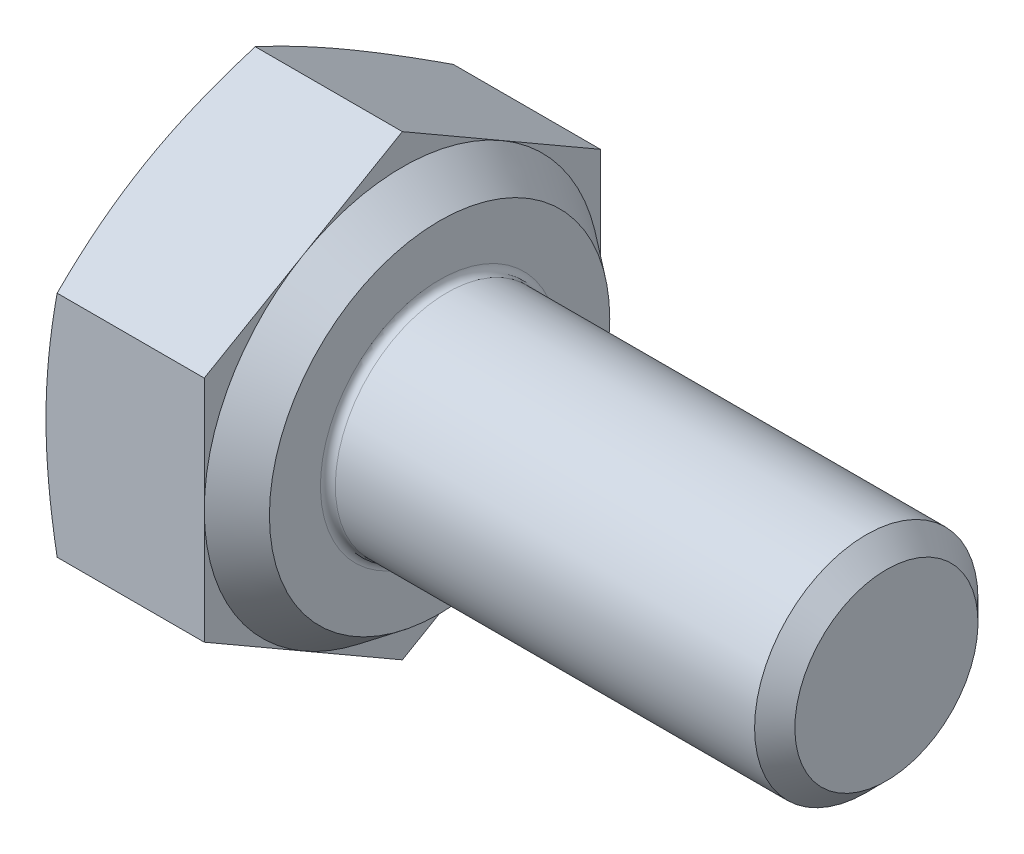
ISO-10303-21;
HEADER;
FILE_DESCRIPTION(('STEP AP214'),'2;1');
FILE_NAME('part.step','',(''),(''),'','','');
FILE_SCHEMA(('AUTOMOTIVE_DESIGN { 1 0 10303 214 1 1 1 1 }'));
ENDSEC;
DATA;
#1=APPLICATION_CONTEXT('core data for automotive mechanical design processes');
#2=APPLICATION_PROTOCOL_DEFINITION('international standard','automotive_design',2000,#1);
#3=PRODUCT_CONTEXT('',#1,'mechanical');
#4=PRODUCT('Part','Part','',(#3));
#5=PRODUCT_RELATED_PRODUCT_CATEGORY('part','',(#4));
#6=PRODUCT_DEFINITION_FORMATION('','',#4);
#7=PRODUCT_DEFINITION_CONTEXT('part definition',#1,'design');
#8=PRODUCT_DEFINITION('design','',#6,#7);
#9=PRODUCT_DEFINITION_SHAPE('','',#8);
#10=(LENGTH_UNIT() NAMED_UNIT(*) SI_UNIT(.MILLI.,.METRE.));
#11=(NAMED_UNIT(*) PLANE_ANGLE_UNIT() SI_UNIT($,.RADIAN.));
#12=(NAMED_UNIT(*) SI_UNIT($,.STERADIAN.) SOLID_ANGLE_UNIT());
#13=UNCERTAINTY_MEASURE_WITH_UNIT(LENGTH_MEASURE(1.E-05),#10,'distance_accuracy_value','');
#14=(GEOMETRIC_REPRESENTATION_CONTEXT(3) GLOBAL_UNCERTAINTY_ASSIGNED_CONTEXT((#13)) GLOBAL_UNIT_ASSIGNED_CONTEXT((#10,
#11,#12)) REPRESENTATION_CONTEXT('',''));
#15=CARTESIAN_POINT('',(0.,0.,0.));
#16=DIRECTION('',(0.,0.,1.));
#17=DIRECTION('',(1.,0.,0.));
#18=AXIS2_PLACEMENT_3D('',#15,#16,#17);
#19=CARTESIAN_POINT('',(2.625,0.,0.));
#20=DIRECTION('',(-1.,0.,0.));
#21=DIRECTION('',(0.,-1.,0.));
#22=AXIS2_PLACEMENT_3D('',#19,#20,#21);
#23=PLANE('',#22);
#24=CARTESIAN_POINT('',(2.625,0.,0.));
#25=DIRECTION('',(-1.,0.,0.));
#26=DIRECTION('',(0.,-1.,0.));
#27=AXIS2_PLACEMENT_3D('',#24,#25,#26);
#28=CIRCLE('',#27,1.6);
#29=CARTESIAN_POINT('',(2.625,-1.6,0.));
#30=VERTEX_POINT('',#29);
#31=EDGE_CURVE('E11',#30,#30,#28,.T.);
#32=ORIENTED_EDGE('',*,*,#31,.T.);
#33=EDGE_LOOP('',(#32));
#34=FACE_BOUND('',#33,.T.);
#35=CARTESIAN_POINT('',(2.625,0.,0.));
#36=DIRECTION('',(-1.,0.,0.));
#37=DIRECTION('',(0.,-1.,0.));
#38=AXIS2_PLACEMENT_3D('',#35,#36,#37);
#39=CIRCLE('',#38,2.285);
#40=CARTESIAN_POINT('',(2.625,-2.28499999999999,0.));
#41=VERTEX_POINT('',#40);
#42=EDGE_CURVE('E140',#41,#41,#39,.T.);
#43=ORIENTED_EDGE('',*,*,#42,.F.);
#44=EDGE_LOOP('',(#43));
#45=FACE_BOUND('',#44,.T.);
#46=ADVANCED_FACE('F32',(#34,#45),#23,.F.);
#47=CARTESIAN_POINT('',(2.125,0.,5.32));
#48=DIRECTION('',(-1.,0.,0.));
#49=DIRECTION('',(0.,0.,1.));
#50=AXIS2_PLACEMENT_3D('',#47,#48,#49);
#51=PLANE('',#50);
#52=DIRECTION('',(0.,-0.5,-0.866025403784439));
#53=VECTOR('',#52,1.);
#54=CARTESIAN_POINT('',(2.125,-1.53575171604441,2.66));
#55=LINE('',#54,#53);
#56=CARTESIAN_POINT('',(2.125,-1.53575171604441,2.66));
#57=VERTEX_POINT('',#56);
#58=CARTESIAN_POINT('',(2.125,-2.30362757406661,1.33));
#59=VERTEX_POINT('',#58);
#60=EDGE_CURVE('E139',#57,#59,#55,.T.);
#61=ORIENTED_EDGE('',*,*,#60,.T.);
#62=CARTESIAN_POINT('',(2.125,0.,0.));
#63=DIRECTION('',(-1.,0.,0.));
#64=DIRECTION('',(0.,-1.,0.));
#65=AXIS2_PLACEMENT_3D('',#62,#63,#64);
#66=CIRCLE('',#65,2.66);
#67=CARTESIAN_POINT('',(2.125,0.,2.66));
#68=VERTEX_POINT('',#67);
#69=EDGE_CURVE('E48',#59,#68,#66,.T.);
#70=ORIENTED_EDGE('',*,*,#69,.T.);
#71=DIRECTION('',(0.,-1.,0.));
#72=VECTOR('',#71,1.);
#73=CARTESIAN_POINT('',(2.125,1.53575171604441,2.66));
#74=LINE('',#73,#72);
#75=EDGE_CURVE('E136',#68,#57,#74,.T.);
#76=ORIENTED_EDGE('',*,*,#75,.T.);
#77=EDGE_LOOP('',(#61,#70,#76));
#78=FACE_BOUND('',#77,.T.);
#79=ADVANCED_FACE('F135',(#78),#51,.F.);
#80=CARTESIAN_POINT('',(2.125,1.53575171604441,2.66));
#81=VERTEX_POINT('',#80);
#82=EDGE_CURVE('E147',#81,#68,#74,.T.);
#83=ORIENTED_EDGE('',*,*,#82,.T.);
#84=CARTESIAN_POINT('',(2.125,2.30362757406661,1.33));
#85=VERTEX_POINT('',#84);
#86=EDGE_CURVE('E122',#68,#85,#66,.T.);
#87=ORIENTED_EDGE('',*,*,#86,.T.);
#88=DIRECTION('',(0.,-0.5,0.866025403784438));
#89=VECTOR('',#88,1.);
#90=CARTESIAN_POINT('',(2.125,3.07150343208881,0.));
#91=LINE('',#90,#89);
#92=EDGE_CURVE('E153',#85,#81,#91,.T.);
#93=ORIENTED_EDGE('',*,*,#92,.T.);
#94=EDGE_LOOP('',(#83,#87,#93));
#95=FACE_BOUND('',#94,.T.);
#96=ADVANCED_FACE('F152',(#95),#51,.F.);
#97=CARTESIAN_POINT('',(2.125,3.07150343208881,0.));
#98=VERTEX_POINT('',#97);
#99=EDGE_CURVE('E150',#98,#85,#91,.T.);
#100=ORIENTED_EDGE('',*,*,#99,.T.);
#101=CARTESIAN_POINT('',(2.125,2.30362757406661,-1.33));
#102=VERTEX_POINT('',#101);
#103=EDGE_CURVE('E126',#85,#102,#66,.T.);
#104=ORIENTED_EDGE('',*,*,#103,.T.);
#105=DIRECTION('',(0.,0.5,0.866025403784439));
#106=VECTOR('',#105,1.);
#107=CARTESIAN_POINT('',(2.125,1.53575171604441,-2.66));
#108=LINE('',#107,#106);
#109=EDGE_CURVE('E309',#102,#98,#108,.T.);
#110=ORIENTED_EDGE('',*,*,#109,.T.);
#111=EDGE_LOOP('',(#100,#104,#110));
#112=FACE_BOUND('',#111,.T.);
#113=ADVANCED_FACE('F298',(#112),#51,.F.);
#114=CARTESIAN_POINT('',(2.125,1.53575171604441,-2.66));
#115=VERTEX_POINT('',#114);
#116=EDGE_CURVE('E312',#115,#102,#108,.T.);
#117=ORIENTED_EDGE('',*,*,#116,.T.);
#118=CARTESIAN_POINT('',(2.125,0.,-2.66));
#119=VERTEX_POINT('',#118);
#120=EDGE_CURVE('E371',#102,#119,#66,.T.);
#121=ORIENTED_EDGE('',*,*,#120,.T.);
#122=DIRECTION('',(0.,1.,0.));
#123=VECTOR('',#122,1.);
#124=CARTESIAN_POINT('',(2.125,-1.53575171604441,-2.66));
#125=LINE('',#124,#123);
#126=EDGE_CURVE('E310',#119,#115,#125,.T.);
#127=ORIENTED_EDGE('',*,*,#126,.T.);
#128=EDGE_LOOP('',(#117,#121,#127));
#129=FACE_BOUND('',#128,.T.);
#130=ADVANCED_FACE('F291',(#129),#51,.F.);
#131=CARTESIAN_POINT('',(2.125,-1.53575171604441,-2.66));
#132=VERTEX_POINT('',#131);
#133=EDGE_CURVE('E303',#132,#119,#125,.T.);
#134=ORIENTED_EDGE('',*,*,#133,.T.);
#135=CARTESIAN_POINT('',(2.125,-2.3036275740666,-1.33));
#136=VERTEX_POINT('',#135);
#137=EDGE_CURVE('E304',#119,#136,#66,.T.);
#138=ORIENTED_EDGE('',*,*,#137,.T.);
#139=DIRECTION('',(0.,0.5,-0.866025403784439));
#140=VECTOR('',#139,1.);
#141=CARTESIAN_POINT('',(2.125,-3.07150343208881,0.));
#142=LINE('',#141,#140);
#143=EDGE_CURVE('E306',#136,#132,#142,.T.);
#144=ORIENTED_EDGE('',*,*,#143,.T.);
#145=EDGE_LOOP('',(#134,#138,#144));
#146=FACE_BOUND('',#145,.T.);
#147=ADVANCED_FACE('F283',(#146),#51,.F.);
#148=CARTESIAN_POINT('',(2.125,-1.53575171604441,2.66));
#149=DIRECTION('',(0.,0.866025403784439,-0.5));
#150=DIRECTION('',(0.,0.5,0.866025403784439));
#151=AXIS2_PLACEMENT_3D('',#148,#149,#150);
#152=PLANE('',#151);
#153=CARTESIAN_POINT('',(0.149817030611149,-3.07161890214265,-0.000199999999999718));
#154=CARTESIAN_POINT('',(0.126655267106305,-3.00801054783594,0.109972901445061));
#155=CARTESIAN_POINT('',(0.105585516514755,-2.94419242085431,0.22050913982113));
#156=CARTESIAN_POINT('',(0.068516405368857,-2.81614115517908,0.442300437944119));
#157=CARTESIAN_POINT('',(0.0525210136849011,-2.75190773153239,0.553555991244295));
#158=CARTESIAN_POINT('',(0.0266488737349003,-2.62373882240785,0.775551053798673));
#159=CARTESIAN_POINT('',(0.0167156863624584,-2.55980626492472,0.886285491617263));
#160=CARTESIAN_POINT('',(0.00339247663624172,-2.43179161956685,1.10801336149));
#161=CARTESIAN_POINT('',(0.,-2.36770959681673,1.219006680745));
#162=CARTESIAN_POINT('',(0.,-2.23954555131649,1.440993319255));
#163=CARTESIAN_POINT('',(0.00339247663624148,-2.17546352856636,1.55198663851));
#164=CARTESIAN_POINT('',(0.016715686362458,-2.04744888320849,1.77371450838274));
#165=CARTESIAN_POINT('',(0.0266488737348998,-1.98351632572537,1.88444894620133));
#166=CARTESIAN_POINT('',(0.0525210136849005,-1.85534741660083,2.10644400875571));
#167=CARTESIAN_POINT('',(0.0685164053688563,-1.79111399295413,2.21769956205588));
#168=CARTESIAN_POINT('',(0.105585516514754,-1.66306272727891,2.43949086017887));
#169=CARTESIAN_POINT('',(0.126655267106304,-1.59924460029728,2.55002709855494));
#170=CARTESIAN_POINT('',(0.149817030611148,-1.53563624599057,2.6602));
#171=B_SPLINE_CURVE_WITH_KNOTS('',3,(#153,#154,#155,#156,#157,#158,#159,#160,#161,#162,#163,
#164,#165,#166,#167,#168,#169,#170),.UNSPECIFIED.,.F.,.F.,(4,2,2,2,2,2,2,2,4),(0.,
0.387964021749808,0.776230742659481,1.16082524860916,1.54527541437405,1.92972558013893,
2.31432008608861,2.70258680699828,3.09055082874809),.UNSPECIFIED.);
#172=CARTESIAN_POINT('',(0.149775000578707,-3.0715034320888,0.));
#173=VERTEX_POINT('',#172);
#174=CARTESIAN_POINT('',(0.,-2.3036275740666,1.33));
#175=VERTEX_POINT('',#174);
#176=EDGE_CURVE('E352',#173,#175,#171,.T.);
#177=ORIENTED_EDGE('',*,*,#176,.F.);
#178=DIRECTION('',(-1.,0.,0.));
#179=VECTOR('',#178,1.);
#180=CARTESIAN_POINT('',(2.125,-3.07150343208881,0.));
#181=LINE('',#180,#179);
#182=CARTESIAN_POINT('',(2.125,-3.07150343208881,0.));
#183=VERTEX_POINT('',#182);
#184=EDGE_CURVE('E170',#183,#173,#181,.T.);
#185=ORIENTED_EDGE('',*,*,#184,.F.);
#186=EDGE_CURVE('E360',#59,#183,#55,.T.);
#187=ORIENTED_EDGE('',*,*,#186,.F.);
#188=ORIENTED_EDGE('',*,*,#60,.F.);
#189=DIRECTION('',(-1.,0.,0.));
#190=VECTOR('',#189,1.);
#191=CARTESIAN_POINT('',(2.125,-1.53575171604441,2.66));
#192=LINE('',#191,#190);
#193=CARTESIAN_POINT('',(0.149775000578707,-1.53575171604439,2.66));
#194=VERTEX_POINT('',#193);
#195=EDGE_CURVE('E149',#57,#194,#192,.T.);
#196=ORIENTED_EDGE('',*,*,#195,.T.);
#197=EDGE_CURVE('E240',#175,#194,#171,.T.);
#198=ORIENTED_EDGE('',*,*,#197,.F.);
#199=EDGE_LOOP('',(#177,#185,#187,#188,#196,#198));
#200=FACE_BOUND('',#199,.T.);
#201=ADVANCED_FACE('F34',(#200),#152,.F.);
#202=CARTESIAN_POINT('',(2.125,-3.07150343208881,0.));
#203=DIRECTION('',(0.,0.866025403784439,0.5));
#204=DIRECTION('',(0.,-0.5,0.866025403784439));
#205=AXIS2_PLACEMENT_3D('',#202,#203,#204);
#206=PLANE('',#205);
#207=CARTESIAN_POINT('',(0.149817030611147,-1.53563624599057,-2.6602));
#208=CARTESIAN_POINT('',(0.126655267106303,-1.59924460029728,-2.55002709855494));
#209=CARTESIAN_POINT('',(0.105585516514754,-1.66306272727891,-2.43949086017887));
#210=CARTESIAN_POINT('',(0.0685164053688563,-1.79111399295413,-2.21769956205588));
#211=CARTESIAN_POINT('',(0.0525210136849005,-1.85534741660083,-2.1064440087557));
#212=CARTESIAN_POINT('',(0.0266488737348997,-1.98351632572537,-1.88444894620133));
#213=CARTESIAN_POINT('',(0.016715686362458,-2.04744888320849,-1.77371450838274));
#214=CARTESIAN_POINT('',(0.00339247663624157,-2.17546352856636,-1.55198663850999));
#215=CARTESIAN_POINT('',(0.,-2.23954555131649,-1.440993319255));
#216=CARTESIAN_POINT('',(0.,-2.36770959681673,-1.219006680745));
#217=CARTESIAN_POINT('',(0.00339247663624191,-2.43179161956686,-1.10801336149));
#218=CARTESIAN_POINT('',(0.0167156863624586,-2.55980626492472,-0.886285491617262));
#219=CARTESIAN_POINT('',(0.0266488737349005,-2.62373882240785,-0.775551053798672));
#220=CARTESIAN_POINT('',(0.0525210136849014,-2.75190773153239,-0.553555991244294));
#221=CARTESIAN_POINT('',(0.0685164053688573,-2.81614115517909,-0.442300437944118));
#222=CARTESIAN_POINT('',(0.105585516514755,-2.94419242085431,-0.220509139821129));
#223=CARTESIAN_POINT('',(0.126655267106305,-3.00801054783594,-0.10997290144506));
#224=CARTESIAN_POINT('',(0.149817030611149,-3.07161890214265,0.000200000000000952));
#225=B_SPLINE_CURVE_WITH_KNOTS('',3,(#207,#208,#209,#210,#211,#212,#213,#214,#215,#216,#217,
#218,#219,#220,#221,#222,#223,#224),.UNSPECIFIED.,.F.,.F.,(4,2,2,2,2,2,2,2,4),(0.,
0.387964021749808,0.77623074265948,1.16082524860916,1.54527541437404,1.92972558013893,
2.31432008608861,2.70258680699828,3.09055082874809),.UNSPECIFIED.);
#226=CARTESIAN_POINT('',(0.149775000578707,-1.53575171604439,-2.66));
#227=VERTEX_POINT('',#226);
#228=CARTESIAN_POINT('',(0.,-2.3036275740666,-1.33));
#229=VERTEX_POINT('',#228);
#230=EDGE_CURVE('E255',#227,#229,#225,.T.);
#231=ORIENTED_EDGE('',*,*,#230,.F.);
#232=DIRECTION('',(-1.,0.,0.));
#233=VECTOR('',#232,1.);
#234=CARTESIAN_POINT('',(2.125,-1.53575171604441,-2.66));
#235=LINE('',#234,#233);
#236=EDGE_CURVE('E167',#132,#227,#235,.T.);
#237=ORIENTED_EDGE('',*,*,#236,.F.);
#238=ORIENTED_EDGE('',*,*,#143,.F.);
#239=EDGE_CURVE('E313',#183,#136,#142,.T.);
#240=ORIENTED_EDGE('',*,*,#239,.F.);
#241=ORIENTED_EDGE('',*,*,#184,.T.);
#242=EDGE_CURVE('E251',#229,#173,#225,.T.);
#243=ORIENTED_EDGE('',*,*,#242,.F.);
#244=EDGE_LOOP('',(#231,#237,#238,#240,#241,#243));
#245=FACE_BOUND('',#244,.T.);
#246=ADVANCED_FACE('F262',(#245),#206,.F.);
#247=CARTESIAN_POINT('',(2.125,-1.53575171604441,-2.66));
#248=DIRECTION('',(0.,0.,1.));
#249=DIRECTION('',(1.,0.,0.));
#250=AXIS2_PLACEMENT_3D('',#247,#248,#249);
#251=PLANE('',#250);
#252=CARTESIAN_POINT('',(0.80033820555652,-4.0661305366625,-2.66));
#253=CARTESIAN_POINT('',(0.763692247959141,-3.9457824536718,-2.66));
#254=CARTESIAN_POINT('',(0.727473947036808,-3.82530183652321,-2.66));
#255=CARTESIAN_POINT('',(0.656129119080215,-3.58400782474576,-2.66));
#256=CARTESIAN_POINT('',(0.621002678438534,-3.4631944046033,-2.66));
#257=CARTESIAN_POINT('',(0.552019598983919,-3.22096029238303,-2.66));
#258=CARTESIAN_POINT('',(0.518165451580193,-3.09953888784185,-2.66));
#259=CARTESIAN_POINT('',(0.452123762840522,-2.85624515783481,-2.66));
#260=CARTESIAN_POINT('',(0.419936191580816,-2.73437284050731,-2.66));
#261=CARTESIAN_POINT('',(0.358023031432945,-2.49160023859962,-2.66));
#262=CARTESIAN_POINT('',(0.328271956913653,-2.37070652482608,-2.66));
#263=CARTESIAN_POINT('',(0.271306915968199,-2.1283243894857,-2.66));
#264=CARTESIAN_POINT('',(0.244093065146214,-2.006835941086,-2.66));
#265=CARTESIAN_POINT('',(0.167186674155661,-1.64142901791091,-2.66));
#266=CARTESIAN_POINT('',(0.122197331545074,-1.39644838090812,-2.66));
#267=CARTESIAN_POINT('',(0.0708271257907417,-1.04074258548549,-2.66));
#268=CARTESIAN_POINT('',(0.0568876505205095,-0.931102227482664,-2.66));
#269=CARTESIAN_POINT('',(0.0332945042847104,-0.711365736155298,-2.66));
#270=CARTESIAN_POINT('',(0.0236403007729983,-0.601269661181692,-2.66));
#271=CARTESIAN_POINT('',(0.00907749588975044,-0.380832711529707,-2.66));
#272=CARTESIAN_POINT('',(0.0041657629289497,-0.270492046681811,-2.66));
#273=CARTESIAN_POINT('',(-0.00066185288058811,-0.0497001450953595,-2.66));
#274=CARTESIAN_POINT('',(-0.000577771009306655,0.0607510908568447,-2.66));
#275=CARTESIAN_POINT('',(0.00459443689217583,0.28209284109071,-2.66));
#276=CARTESIAN_POINT('',(0.00970784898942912,0.392982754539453,-2.66));
#277=CARTESIAN_POINT('',(0.0247038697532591,0.614440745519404,-2.66));
#278=CARTESIAN_POINT('',(0.0345867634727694,0.725008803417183,-2.66));
#279=CARTESIAN_POINT('',(0.058658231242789,0.94576301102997,-2.66));
#280=CARTESIAN_POINT('',(0.0728504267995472,1.05594876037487,-2.66));
#281=CARTESIAN_POINT('',(0.104968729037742,1.27576754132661,-2.66));
#282=CARTESIAN_POINT('',(0.122894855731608,1.38540056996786,-2.66));
#283=CARTESIAN_POINT('',(0.183438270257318,1.72501827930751,-2.66));
#284=CARTESIAN_POINT('',(0.231440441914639,1.95404028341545,-2.66));
#285=CARTESIAN_POINT('',(0.336683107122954,2.40995741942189,-2.66));
#286=CARTESIAN_POINT('',(0.393926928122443,2.63685175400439,-2.66));
#287=CARTESIAN_POINT('',(0.514573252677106,3.08929571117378,-2.66));
#288=CARTESIAN_POINT('',(0.577983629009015,3.31484321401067,-2.66));
#289=CARTESIAN_POINT('',(0.708883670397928,3.76470051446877,-2.66));
#290=CARTESIAN_POINT('',(0.776372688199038,3.9890105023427,-2.66));
#291=CARTESIAN_POINT('',(0.91341260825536,4.43428675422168,-2.66));
#292=CARTESIAN_POINT('',(0.98293252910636,4.65526259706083,-2.66));
#293=CARTESIAN_POINT('',(1.12394706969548,5.0965928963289,-2.66));
#294=CARTESIAN_POINT('',(1.19544178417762,5.31694732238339,-2.66));
#295=CARTESIAN_POINT('',(1.33959659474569,5.75634755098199,-2.66));
#296=CARTESIAN_POINT('',(1.41225123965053,5.9753951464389,-2.66));
#297=CARTESIAN_POINT('',(1.55864986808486,6.41310625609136,-2.66));
#298=CARTESIAN_POINT('',(1.63239376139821,6.63176980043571,-2.66));
#299=CARTESIAN_POINT('',(1.70651873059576,6.8503022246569,-2.66));
#300=B_SPLINE_CURVE_WITH_KNOTS('',3,(#252,#253,#254,#255,#256,#257,#258,#259,#260,#261,#262,
#263,#264,#265,#266,#267,#268,#269,#270,#271,#272,#273,#274,#275,#276,#277,#278,#279,#280,#281,
#282,#283,#284,#285,#286,#287,#288,#289,#290,#291,#292,#293,#294,#295,#296,#297,#298,#299),
.UNSPECIFIED.,.F.,.F.,(4,2,2,2,2,2,2,2,2,2,2,2,2,2,2,2,2,2,2,2,2,2,2,4),(0.,0.377413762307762,
0.75485731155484,1.13300507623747,1.51114604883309,1.88461936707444,2.25810969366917,
3.004716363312,3.3362177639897,3.66767795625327,3.99891912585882,4.33015795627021,
4.663070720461,4.99600338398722,5.32921661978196,5.66243164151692,6.36408571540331,
7.06599298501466,7.76880844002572,8.47151265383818,9.16646049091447,9.86144172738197,
10.5537859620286,11.2460731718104),.UNSPECIFIED.);
#301=CARTESIAN_POINT('',(0.149775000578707,1.53575171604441,-2.66));
#302=VERTEX_POINT('',#301);
#303=CARTESIAN_POINT('',(0.,0.,-2.66));
#304=VERTEX_POINT('',#303);
#305=EDGE_CURVE('E361',#302,#304,#300,.F.);
#306=ORIENTED_EDGE('',*,*,#305,.F.);
#307=DIRECTION('',(-1.,0.,0.));
#308=VECTOR('',#307,1.);
#309=CARTESIAN_POINT('',(2.125,1.53575171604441,-2.66));
#310=LINE('',#309,#308);
#311=EDGE_CURVE('E164',#115,#302,#310,.T.);
#312=ORIENTED_EDGE('',*,*,#311,.F.);
#313=ORIENTED_EDGE('',*,*,#126,.F.);
#314=ORIENTED_EDGE('',*,*,#133,.F.);
#315=ORIENTED_EDGE('',*,*,#236,.T.);
#316=EDGE_CURVE('E256',#304,#227,#300,.F.);
#317=ORIENTED_EDGE('',*,*,#316,.F.);
#318=EDGE_LOOP('',(#306,#312,#313,#314,#315,#317));
#319=FACE_BOUND('',#318,.T.);
#320=ADVANCED_FACE('F265',(#319),#251,.F.);
#321=CARTESIAN_POINT('',(2.125,1.53575171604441,-2.66));
#322=DIRECTION('',(0.,-0.866025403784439,0.5));
#323=DIRECTION('',(0.,-0.5,-0.866025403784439));
#324=AXIS2_PLACEMENT_3D('',#321,#322,#323);
#325=PLANE('',#324);
#326=CARTESIAN_POINT('',(0.149817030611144,3.07161890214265,0.000200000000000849));
#327=CARTESIAN_POINT('',(0.1266552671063,3.00801054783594,-0.10997290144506));
#328=CARTESIAN_POINT('',(0.10558551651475,2.94419242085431,-0.220509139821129));
#329=CARTESIAN_POINT('',(0.0685164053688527,2.81614115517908,-0.442300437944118));
#330=CARTESIAN_POINT('',(0.0525210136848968,2.75190773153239,-0.553555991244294));
#331=CARTESIAN_POINT('',(0.0266488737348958,2.62373882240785,-0.775551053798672));
#332=CARTESIAN_POINT('',(0.0167156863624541,2.55980626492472,-0.886285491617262));
#333=CARTESIAN_POINT('',(0.0033924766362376,2.43179161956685,-1.10801336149));
#334=CARTESIAN_POINT('',(0.,2.36770959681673,-1.219006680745));
#335=CARTESIAN_POINT('',(0.,2.23954555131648,-1.440993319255));
#336=CARTESIAN_POINT('',(0.00339247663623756,2.17546352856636,-1.55198663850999));
#337=CARTESIAN_POINT('',(0.0167156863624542,2.04744888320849,-1.77371450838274));
#338=CARTESIAN_POINT('',(0.0266488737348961,1.98351632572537,-1.88444894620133));
#339=CARTESIAN_POINT('',(0.0525210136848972,1.85534741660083,-2.1064440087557));
#340=CARTESIAN_POINT('',(0.0685164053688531,1.79111399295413,-2.21769956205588));
#341=CARTESIAN_POINT('',(0.105585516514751,1.66306272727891,-2.43949086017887));
#342=CARTESIAN_POINT('',(0.126655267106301,1.59924460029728,-2.55002709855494));
#343=CARTESIAN_POINT('',(0.149817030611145,1.53563624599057,-2.6602));
#344=B_SPLINE_CURVE_WITH_KNOTS('',3,(#326,#327,#328,#329,#330,#331,#332,#333,#334,#335,#336,
#337,#338,#339,#340,#341,#342,#343),.UNSPECIFIED.,.F.,.F.,(4,2,2,2,2,2,2,2,4),(0.,
0.387964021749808,0.776230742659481,1.16082524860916,1.54527541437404,1.92972558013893,
2.31432008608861,2.70258680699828,3.09055082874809),.UNSPECIFIED.);
#345=CARTESIAN_POINT('',(0.149775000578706,3.07150343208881,0.));
#346=VERTEX_POINT('',#345);
#347=CARTESIAN_POINT('',(0.,2.30362757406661,-1.33));
#348=VERTEX_POINT('',#347);
#349=EDGE_CURVE('E245',#346,#348,#344,.T.);
#350=ORIENTED_EDGE('',*,*,#349,.F.);
#351=DIRECTION('',(-1.,0.,0.));
#352=VECTOR('',#351,1.);
#353=CARTESIAN_POINT('',(2.125,3.07150343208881,0.));
#354=LINE('',#353,#352);
#355=EDGE_CURVE('E161',#98,#346,#354,.T.);
#356=ORIENTED_EDGE('',*,*,#355,.F.);
#357=ORIENTED_EDGE('',*,*,#109,.F.);
#358=ORIENTED_EDGE('',*,*,#116,.F.);
#359=ORIENTED_EDGE('',*,*,#311,.T.);
#360=EDGE_CURVE('E353',#348,#302,#344,.T.);
#361=ORIENTED_EDGE('',*,*,#360,.F.);
#362=EDGE_LOOP('',(#350,#356,#357,#358,#359,#361));
#363=FACE_BOUND('',#362,.T.);
#364=ADVANCED_FACE('F269',(#363),#325,.F.);
#365=CARTESIAN_POINT('',(2.125,3.07150343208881,0.));
#366=DIRECTION('',(0.,-0.866025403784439,-0.5));
#367=DIRECTION('',(0.,0.5,-0.866025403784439));
#368=AXIS2_PLACEMENT_3D('',#365,#366,#367);
#369=PLANE('',#368);
#370=CARTESIAN_POINT('',(0.149817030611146,1.53563624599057,2.6602));
#371=CARTESIAN_POINT('',(0.126655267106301,1.59924460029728,2.55002709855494));
#372=CARTESIAN_POINT('',(0.105585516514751,1.66306272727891,2.43949086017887));
#373=CARTESIAN_POINT('',(0.0685164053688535,1.79111399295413,2.21769956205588));
#374=CARTESIAN_POINT('',(0.0525210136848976,1.85534741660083,2.10644400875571));
#375=CARTESIAN_POINT('',(0.0266488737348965,1.98351632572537,1.88444894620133));
#376=CARTESIAN_POINT('',(0.0167156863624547,2.04744888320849,1.77371450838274));
#377=CARTESIAN_POINT('',(0.00339247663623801,2.17546352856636,1.55198663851));
#378=CARTESIAN_POINT('',(0.,2.23954555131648,1.440993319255));
#379=CARTESIAN_POINT('',(0.,2.36770959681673,1.219006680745));
#380=CARTESIAN_POINT('',(0.00339247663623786,2.43179161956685,1.10801336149));
#381=CARTESIAN_POINT('',(0.0167156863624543,2.55980626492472,0.886285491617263));
#382=CARTESIAN_POINT('',(0.0266488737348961,2.62373882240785,0.775551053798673));
#383=CARTESIAN_POINT('',(0.052521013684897,2.75190773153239,0.553555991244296));
#384=CARTESIAN_POINT('',(0.0685164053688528,2.81614115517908,0.44230043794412));
#385=CARTESIAN_POINT('',(0.10558551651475,2.94419242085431,0.22050913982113));
#386=CARTESIAN_POINT('',(0.1266552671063,3.00801054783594,0.109972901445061));
#387=CARTESIAN_POINT('',(0.149817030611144,3.07161890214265,-0.000199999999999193));
#388=B_SPLINE_CURVE_WITH_KNOTS('',3,(#370,#371,#372,#373,#374,#375,#376,#377,#378,#379,#380,
#381,#382,#383,#384,#385,#386,#387),.UNSPECIFIED.,.F.,.F.,(4,2,2,2,2,2,2,2,4),(0.,
0.387964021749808,0.776230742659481,1.16082524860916,1.54527541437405,1.92972558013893,
2.31432008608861,2.70258680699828,3.09055082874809),.UNSPECIFIED.);
#389=CARTESIAN_POINT('',(0.149775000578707,1.5357517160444,2.66));
#390=VERTEX_POINT('',#389);
#391=CARTESIAN_POINT('',(0.,2.30362757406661,1.33));
#392=VERTEX_POINT('',#391);
#393=EDGE_CURVE('E233',#390,#392,#388,.T.);
#394=ORIENTED_EDGE('',*,*,#393,.F.);
#395=DIRECTION('',(-1.,0.,0.));
#396=VECTOR('',#395,1.);
#397=CARTESIAN_POINT('',(2.125,1.53575171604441,2.66));
#398=LINE('',#397,#396);
#399=EDGE_CURVE('E155',#81,#390,#398,.T.);
#400=ORIENTED_EDGE('',*,*,#399,.F.);
#401=ORIENTED_EDGE('',*,*,#92,.F.);
#402=ORIENTED_EDGE('',*,*,#99,.F.);
#403=ORIENTED_EDGE('',*,*,#355,.T.);
#404=EDGE_CURVE('E345',#392,#346,#388,.T.);
#405=ORIENTED_EDGE('',*,*,#404,.F.);
#406=EDGE_LOOP('',(#394,#400,#401,#402,#403,#405));
#407=FACE_BOUND('',#406,.T.);
#408=ADVANCED_FACE('F273',(#407),#369,.F.);
#409=CARTESIAN_POINT('',(2.125,1.53575171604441,2.66));
#410=DIRECTION('',(0.,0.,-1.));
#411=DIRECTION('',(0.,1.,0.));
#412=AXIS2_PLACEMENT_3D('',#409,#410,#411);
#413=PLANE('',#412);
#414=CARTESIAN_POINT('',(0.800338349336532,-4.06613100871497,2.66));
#415=CARTESIAN_POINT('',(0.763692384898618,-3.94578290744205,2.66));
#416=CARTESIAN_POINT('',(0.727474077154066,-3.82530227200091,2.66));
#417=CARTESIAN_POINT('',(0.656129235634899,-3.58400822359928,2.66));
#418=CARTESIAN_POINT('',(0.621002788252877,-3.46319478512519,2.66));
#419=CARTESIAN_POINT('',(0.552019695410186,-3.22096063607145,2.66));
#420=CARTESIAN_POINT('',(0.518165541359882,-3.09953921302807,2.66));
#421=CARTESIAN_POINT('',(0.452123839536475,-2.85624544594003,2.66));
#422=CARTESIAN_POINT('',(0.4199362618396,-2.73437311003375,2.66));
#423=CARTESIAN_POINT('',(0.358023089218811,-2.4916004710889,2.66));
#424=CARTESIAN_POINT('',(0.328272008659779,-2.37070673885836,2.66));
#425=CARTESIAN_POINT('',(0.271306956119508,-2.12832456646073,2.66));
#426=CARTESIAN_POINT('',(0.244093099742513,-2.00683609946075,2.66));
#427=CARTESIAN_POINT('',(0.167186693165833,-1.6414291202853,2.66));
#428=CARTESIAN_POINT('',(0.122197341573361,-1.39644844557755,2.66));
#429=CARTESIAN_POINT('',(0.0708271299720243,-1.0407426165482,2.66));
#430=CARTESIAN_POINT('',(0.0568876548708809,-0.931102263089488,2.66));
#431=CARTESIAN_POINT('',(0.0332945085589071,-0.711365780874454,2.66));
#432=CARTESIAN_POINT('',(0.0236403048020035,-0.60126971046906,2.66));
#433=CARTESIAN_POINT('',(0.00907749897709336,-0.380832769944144,2.66));
#434=CARTESIAN_POINT('',(0.00416576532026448,-0.270492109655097,2.66));
#435=CARTESIAN_POINT('',(-0.000661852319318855,-0.0497002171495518,2.66));
#436=CARTESIAN_POINT('',(-0.000577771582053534,0.0607510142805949,2.66));
#437=CARTESIAN_POINT('',(0.00459443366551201,0.28209275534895,2.66));
#438=CARTESIAN_POINT('',(0.00970784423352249,0.392982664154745,2.66));
#439=CARTESIAN_POINT('',(0.0247038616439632,0.614440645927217,2.66));
#440=CARTESIAN_POINT('',(0.0345867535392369,0.725008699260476,2.66));
#441=CARTESIAN_POINT('',(0.0586582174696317,0.945762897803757,2.66));
#442=CARTESIAN_POINT('',(0.0728504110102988,1.0559486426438,2.66));
#443=CARTESIAN_POINT('',(0.10496870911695,1.27576741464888,2.66));
#444=CARTESIAN_POINT('',(0.122894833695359,1.38540043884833,2.66));
#445=CARTESIAN_POINT('',(0.183438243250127,1.72501814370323,2.66));
#446=CARTESIAN_POINT('',(0.231440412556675,1.95404014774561,2.66));
#447=CARTESIAN_POINT('',(0.336683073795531,2.40995728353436,2.66));
#448=CARTESIAN_POINT('',(0.39392689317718,2.63685161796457,2.66));
#449=CARTESIAN_POINT('',(0.514573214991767,3.0892955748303,2.66));
#450=CARTESIAN_POINT('',(0.577983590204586,3.31484307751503,2.66));
#451=CARTESIAN_POINT('',(0.708883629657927,3.76470037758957,2.66));
#452=CARTESIAN_POINT('',(0.776372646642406,3.98901036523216,2.66));
#453=CARTESIAN_POINT('',(0.913412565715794,4.43428661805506,2.66));
#454=CARTESIAN_POINT('',(0.982932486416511,4.65526246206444,2.66));
#455=CARTESIAN_POINT('',(1.12394702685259,5.09659276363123,2.66));
#456=CARTESIAN_POINT('',(1.195441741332,5.31694719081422,2.66));
#457=CARTESIAN_POINT('',(1.33959655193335,5.756347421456,2.66));
#458=CARTESIAN_POINT('',(1.41225119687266,5.9753950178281,2.66));
#459=CARTESIAN_POINT('',(1.55864982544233,6.41310612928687,2.66));
#460=CARTESIAN_POINT('',(1.63239371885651,6.63176967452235,2.66));
#461=CARTESIAN_POINT('',(1.70651868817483,6.85030209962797,2.66));
#462=B_SPLINE_CURVE_WITH_KNOTS('',3,(#414,#415,#416,#417,#418,#419,#420,#421,#422,#423,#424,
#425,#426,#427,#428,#429,#430,#431,#432,#433,#434,#435,#436,#437,#438,#439,#440,#441,#442,#443,
#444,#445,#446,#447,#448,#449,#450,#451,#452,#453,#454,#455,#456,#457,#458,#459,#460,#461),
.UNSPECIFIED.,.F.,.F.,(4,2,2,2,2,2,2,2,2,2,2,2,2,2,2,2,2,2,2,2,2,2,2,4),(0.,0.377413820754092,
0.754857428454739,1.13300525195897,1.51114628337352,1.88461965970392,2.2581100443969,
3.00471682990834,3.33621821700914,3.66767839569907,3.99891955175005,4.33015836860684,
4.66307111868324,4.99600376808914,5.32921698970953,5.66243199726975,6.36408606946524,
7.06599333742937,7.76880879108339,8.4715130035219,9.16646084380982,9.86144208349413,
10.5537863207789,11.2460735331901),.UNSPECIFIED.);
#463=CARTESIAN_POINT('',(0.,0.,2.66));
#464=VERTEX_POINT('',#463);
#465=EDGE_CURVE('E326',#194,#464,#462,.T.);
#466=ORIENTED_EDGE('',*,*,#465,.F.);
#467=ORIENTED_EDGE('',*,*,#195,.F.);
#468=ORIENTED_EDGE('',*,*,#75,.F.);
#469=ORIENTED_EDGE('',*,*,#82,.F.);
#470=ORIENTED_EDGE('',*,*,#399,.T.);
#471=EDGE_CURVE('E223',#464,#390,#462,.T.);
#472=ORIENTED_EDGE('',*,*,#471,.F.);
#473=EDGE_LOOP('',(#466,#467,#468,#469,#470,#472));
#474=FACE_BOUND('',#473,.T.);
#475=ADVANCED_FACE('F145',(#474),#413,.F.);
#476=ORIENTED_EDGE('',*,*,#239,.T.);
#477=EDGE_CURVE('E141',#136,#59,#66,.T.);
#478=ORIENTED_EDGE('',*,*,#477,.T.);
#479=ORIENTED_EDGE('',*,*,#186,.T.);
#480=EDGE_LOOP('',(#476,#478,#479));
#481=FACE_BOUND('',#480,.T.);
#482=ADVANCED_FACE('F206',(#481),#51,.F.);
#483=CARTESIAN_POINT('',(0.,0.,0.));
#484=DIRECTION('',(1.,0.,0.));
#485=DIRECTION('',(0.,1.,0.));
#486=AXIS2_PLACEMENT_3D('',#483,#484,#485);
#487=CONICAL_SURFACE('',#486,2.66,1.22173047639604);
#488=ORIENTED_EDGE('',*,*,#197,.T.);
#489=ORIENTED_EDGE('',*,*,#465,.T.);
#490=CARTESIAN_POINT('',(0.,0.,0.));
#491=DIRECTION('',(-1.,0.,0.));
#492=DIRECTION('',(0.,-1.,0.));
#493=AXIS2_PLACEMENT_3D('',#490,#491,#492);
#494=CIRCLE('',#493,2.66);
#495=EDGE_CURVE('E56',#175,#464,#494,.T.);
#496=ORIENTED_EDGE('',*,*,#495,.F.);
#497=EDGE_LOOP('',(#488,#489,#496));
#498=FACE_BOUND('',#497,.T.);
#499=ADVANCED_FACE('F281',(#498),#487,.T.);
#500=ORIENTED_EDGE('',*,*,#242,.T.);
#501=ORIENTED_EDGE('',*,*,#176,.T.);
#502=CARTESIAN_POINT('',(0.,0.,0.));
#503=DIRECTION('',(-1.,0.,0.));
#504=DIRECTION('',(0.,0.,1.));
#505=AXIS2_PLACEMENT_3D('',#502,#503,#504);
#506=CIRCLE('',#505,2.66);
#507=EDGE_CURVE('E173',#229,#175,#506,.T.);
#508=ORIENTED_EDGE('',*,*,#507,.F.);
#509=EDGE_LOOP('',(#500,#501,#508));
#510=FACE_BOUND('',#509,.T.);
#511=ADVANCED_FACE('F287',(#510),#487,.T.);
#512=ORIENTED_EDGE('',*,*,#316,.T.);
#513=ORIENTED_EDGE('',*,*,#230,.T.);
#514=EDGE_CURVE('E369',#304,#229,#506,.T.);
#515=ORIENTED_EDGE('',*,*,#514,.F.);
#516=EDGE_LOOP('',(#512,#513,#515));
#517=FACE_BOUND('',#516,.T.);
#518=ADVANCED_FACE('F216',(#517),#487,.T.);
#519=ORIENTED_EDGE('',*,*,#305,.T.);
#520=EDGE_CURVE('E351',#348,#304,#506,.T.);
#521=ORIENTED_EDGE('',*,*,#520,.F.);
#522=ORIENTED_EDGE('',*,*,#360,.T.);
#523=EDGE_LOOP('',(#519,#521,#522));
#524=FACE_BOUND('',#523,.T.);
#525=ADVANCED_FACE('F211',(#524),#487,.T.);
#526=ORIENTED_EDGE('',*,*,#349,.T.);
#527=EDGE_CURVE('E176',#392,#348,#506,.T.);
#528=ORIENTED_EDGE('',*,*,#527,.F.);
#529=ORIENTED_EDGE('',*,*,#404,.T.);
#530=EDGE_LOOP('',(#526,#528,#529));
#531=FACE_BOUND('',#530,.T.);
#532=ADVANCED_FACE('F215',(#531),#487,.T.);
#533=ORIENTED_EDGE('',*,*,#393,.T.);
#534=EDGE_CURVE('E174',#464,#392,#506,.T.);
#535=ORIENTED_EDGE('',*,*,#534,.F.);
#536=ORIENTED_EDGE('',*,*,#471,.T.);
#537=EDGE_LOOP('',(#533,#535,#536));
#538=FACE_BOUND('',#537,.T.);
#539=ADVANCED_FACE('F218',(#538),#487,.T.);
#540=CARTESIAN_POINT('',(0.,0.,5.32));
#541=DIRECTION('',(-1.,0.,0.));
#542=DIRECTION('',(0.,0.,1.));
#543=AXIS2_PLACEMENT_3D('',#540,#541,#542);
#544=PLANE('',#543);
#545=ORIENTED_EDGE('',*,*,#495,.T.);
#546=ORIENTED_EDGE('',*,*,#534,.T.);
#547=ORIENTED_EDGE('',*,*,#527,.T.);
#548=ORIENTED_EDGE('',*,*,#520,.T.);
#549=ORIENTED_EDGE('',*,*,#514,.T.);
#550=ORIENTED_EDGE('',*,*,#507,.T.);
#551=EDGE_LOOP('',(#545,#546,#547,#548,#549,#550));
#552=FACE_BOUND('',#551,.T.);
#553=ADVANCED_FACE('F219',(#552),#544,.T.);
#554=CARTESIAN_POINT('',(2.625,0.,0.));
#555=DIRECTION('',(-1.,0.,0.));
#556=DIRECTION('',(0.,-1.,0.));
#557=AXIS2_PLACEMENT_3D('',#554,#555,#556);
#558=CONICAL_SURFACE('',#557,2.285,0.643501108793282);
#559=ORIENTED_EDGE('',*,*,#69,.F.);
#560=ORIENTED_EDGE('',*,*,#477,.F.);
#561=ORIENTED_EDGE('',*,*,#137,.F.);
#562=ORIENTED_EDGE('',*,*,#120,.F.);
#563=ORIENTED_EDGE('',*,*,#103,.F.);
#564=ORIENTED_EDGE('',*,*,#86,.F.);
#565=EDGE_LOOP('',(#559,#560,#561,#562,#563,#564));
#566=FACE_BOUND('',#565,.T.);
#567=ORIENTED_EDGE('',*,*,#42,.T.);
#568=EDGE_LOOP('',(#567));
#569=FACE_BOUND('',#568,.T.);
#570=ADVANCED_FACE('F123',(#566,#569),#558,.T.);
#571=CARTESIAN_POINT('',(8.625,0.,0.));
#572=DIRECTION('',(-1.,0.,0.));
#573=DIRECTION('',(0.,-1.,0.));
#574=AXIS2_PLACEMENT_3D('',#571,#572,#573);
#575=CYLINDRICAL_SURFACE('',#574,1.5);
#576=CARTESIAN_POINT('',(2.725,0.,0.));
#577=DIRECTION('',(-1.,0.,0.));
#578=DIRECTION('',(0.,-1.,0.));
#579=AXIS2_PLACEMENT_3D('',#576,#577,#578);
#580=CIRCLE('',#579,1.5);
#581=CARTESIAN_POINT('',(2.725,-1.5,0.));
#582=VERTEX_POINT('',#581);
#583=EDGE_CURVE('E41',#582,#582,#580,.F.);
#584=ORIENTED_EDGE('',*,*,#583,.T.);
#585=EDGE_LOOP('',(#584));
#586=FACE_BOUND('',#585,.T.);
#587=CARTESIAN_POINT('',(8.3545,0.,0.));
#588=DIRECTION('',(1.,0.,0.));
#589=DIRECTION('',(0.,1.,0.));
#590=AXIS2_PLACEMENT_3D('',#587,#588,#589);
#591=CIRCLE('',#590,1.5);
#592=CARTESIAN_POINT('',(8.3545,1.5,0.));
#593=VERTEX_POINT('',#592);
#594=EDGE_CURVE('E179',#593,#593,#591,.F.);
#595=ORIENTED_EDGE('',*,*,#594,.T.);
#596=EDGE_LOOP('',(#595));
#597=FACE_BOUND('',#596,.T.);
#598=ADVANCED_FACE('F184',(#586,#597),#575,.T.);
#599=CARTESIAN_POINT('',(8.625,0.,0.));
#600=DIRECTION('',(1.,0.,0.));
#601=DIRECTION('',(0.,1.,0.));
#602=AXIS2_PLACEMENT_3D('',#599,#600,#601);
#603=PLANE('',#602);
#604=CARTESIAN_POINT('',(8.625,0.,0.));
#605=DIRECTION('',(1.,0.,0.));
#606=DIRECTION('',(0.,1.,0.));
#607=AXIS2_PLACEMENT_3D('',#604,#605,#606);
#608=CIRCLE('',#607,1.2295);
#609=CARTESIAN_POINT('',(8.625,1.2295,0.));
#610=VERTEX_POINT('',#609);
#611=EDGE_CURVE('E130',#610,#610,#608,.T.);
#612=ORIENTED_EDGE('',*,*,#611,.T.);
#613=EDGE_LOOP('',(#612));
#614=FACE_BOUND('',#613,.T.);
#615=ADVANCED_FACE('F195',(#614),#603,.T.);
#616=CARTESIAN_POINT('',(8.625,0.,0.));
#617=DIRECTION('',(-1.,0.,0.));
#618=DIRECTION('',(0.,-1.,0.));
#619=AXIS2_PLACEMENT_3D('',#616,#617,#618);
#620=CONICAL_SURFACE('',#619,1.2295,0.785398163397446);
#621=ORIENTED_EDGE('',*,*,#594,.F.);
#622=EDGE_LOOP('',(#621));
#623=FACE_BOUND('',#622,.T.);
#624=ORIENTED_EDGE('',*,*,#611,.F.);
#625=EDGE_LOOP('',(#624));
#626=FACE_BOUND('',#625,.T.);
#627=ADVANCED_FACE('F189',(#623,#626),#620,.T.);
#628=CARTESIAN_POINT('',(2.725,0.,0.));
#629=DIRECTION('',(-1.,0.,0.));
#630=DIRECTION('',(0.,-1.,0.));
#631=AXIS2_PLACEMENT_3D('',#628,#629,#630);
#632=TOROIDAL_SURFACE('',#631,1.6,0.1);
#633=ORIENTED_EDGE('',*,*,#31,.F.);
#634=EDGE_LOOP('',(#633));
#635=FACE_BOUND('',#634,.T.);
#636=ORIENTED_EDGE('',*,*,#583,.F.);
#637=EDGE_LOOP('',(#636));
#638=FACE_BOUND('',#637,.T.);
#639=ADVANCED_FACE('F187',(#635,#638),#632,.F.);
#640=CLOSED_SHELL('',(#46,#79,#96,#113,#130,#147,#201,#246,#320,#364,#408,#475,#482,#499,#511,
#518,#525,#532,#539,#553,#570,#598,#615,#627,#639));
#641=MANIFOLD_SOLID_BREP('B2',#640);
#642=ADVANCED_BREP_SHAPE_REPRESENTATION('',(#18,#641),#14);
#643=SHAPE_DEFINITION_REPRESENTATION(#9,#642);
ENDSEC;
END-ISO-10303-21;
